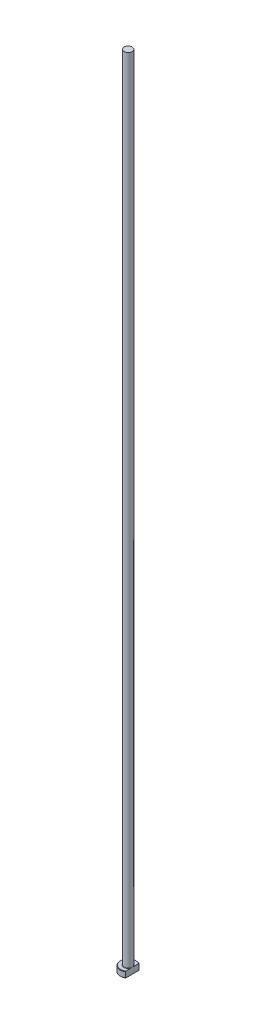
from build123d import *
from build123d.topology import SkipClean

# Parameters (mm, degrees)
CHAMFER1_SIZE = 0.2
FILLET1_R     = 0.2
KEY_DEPTH     = 401.039998


with BuildPart() as part:
    # Sketch1 → Revolve1 (revolve)
    with BuildSketch(Plane.XY, mode=Mode.PRIVATE) as revolve1_sk:
        Polygon((0, 0), (-4, 0), (-4, 3), (-2, 3), (-2, 400), (0, 400), align=None)
    revolve(revolve1_sk.sketch.rotate(Axis((0, 259.958771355, 0), (0, -1, 0)), 270), axis=Axis((0, 259.958771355, 0), (0, -1, 0)))

    # Chamfer1
    chamfer1_edges = [part.edges().sort_by_distance(p)[0] for p in [
        (0, 3, -4),
        (0, 0, -4),
    ]]
    chamfer(chamfer1_edges, length=CHAMFER1_SIZE)

    # Fillet1
    fillet1_edges = [part.edges().sort_by_distance(p)[0] for p in [
        (0, 3, -2),
    ]]
    fillet(fillet1_edges, radius=FILLET1_R)

    # Sketch2 → KEY (cut, through all)
    with SkipClean():  # the faces are left unmerged after this step: merging them gives an invalid solid
        with BuildSketch(Plane(origin=(0, 0, 0), x_dir=(1, 0, 0), z_dir=(0, 1, 0))):
            with BuildLine():
                Line((2, 3.464101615), (2, -3.464101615))
                ThreePointArc((2, -3.464101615), (4, 0), (2, 3.464101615))
            make_face()
        extrude(amount=KEY_DEPTH, mode=Mode.SUBTRACT)


solid = part.part
